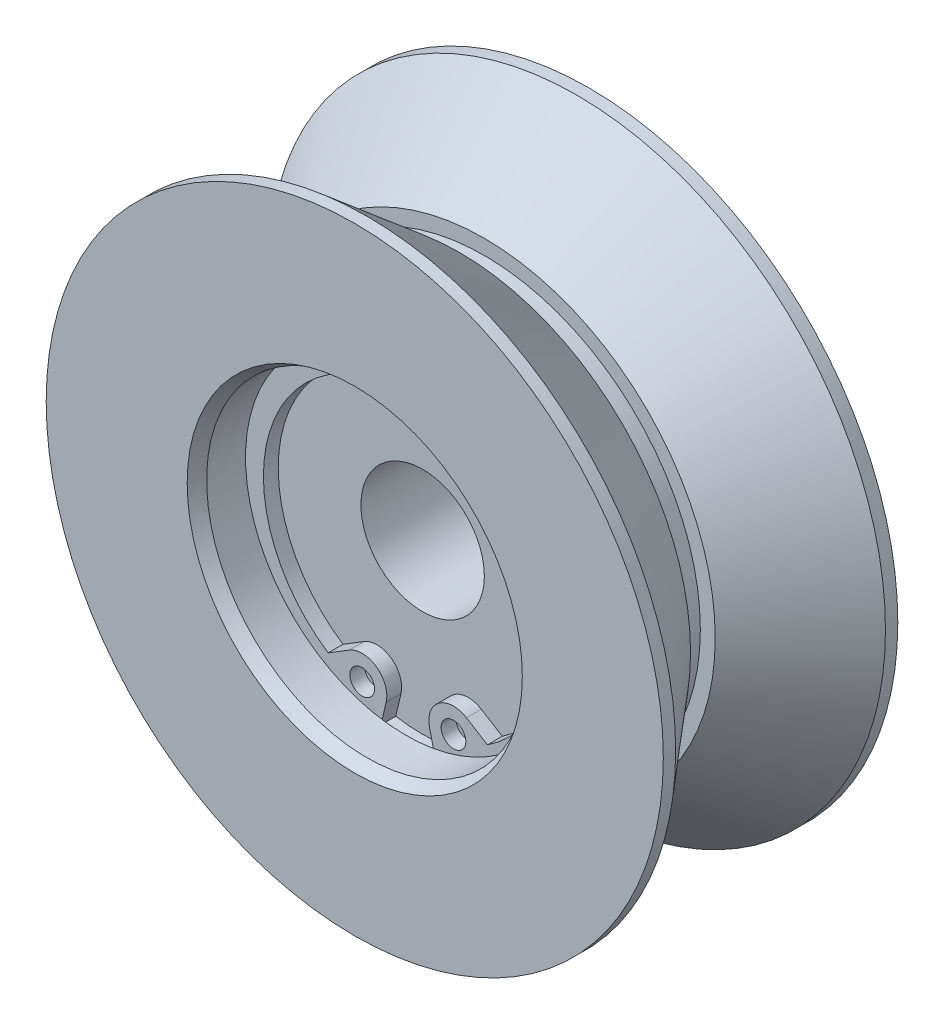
ISO-10303-21;
HEADER;
FILE_DESCRIPTION(('STEP AP214'),'2;1');
FILE_NAME('part.step','',(''),(''),'','','');
FILE_SCHEMA(('AUTOMOTIVE_DESIGN { 1 0 10303 214 1 1 1 1 }'));
ENDSEC;
DATA;
#1=APPLICATION_CONTEXT('core data for automotive mechanical design processes');
#2=APPLICATION_PROTOCOL_DEFINITION('international standard','automotive_design',2000,#1);
#3=PRODUCT_CONTEXT('',#1,'mechanical');
#4=PRODUCT('Part','Part','',(#3));
#5=PRODUCT_RELATED_PRODUCT_CATEGORY('part','',(#4));
#6=PRODUCT_DEFINITION_FORMATION('','',#4);
#7=PRODUCT_DEFINITION_CONTEXT('part definition',#1,'design');
#8=PRODUCT_DEFINITION('design','',#6,#7);
#9=PRODUCT_DEFINITION_SHAPE('','',#8);
#10=(LENGTH_UNIT() NAMED_UNIT(*) SI_UNIT(.MILLI.,.METRE.));
#11=(NAMED_UNIT(*) PLANE_ANGLE_UNIT() SI_UNIT($,.RADIAN.));
#12=(NAMED_UNIT(*) SI_UNIT($,.STERADIAN.) SOLID_ANGLE_UNIT());
#13=UNCERTAINTY_MEASURE_WITH_UNIT(LENGTH_MEASURE(1.E-05),#10,'distance_accuracy_value','');
#14=(GEOMETRIC_REPRESENTATION_CONTEXT(3) GLOBAL_UNCERTAINTY_ASSIGNED_CONTEXT((#13)) GLOBAL_UNIT_ASSIGNED_CONTEXT((#10,
#11,#12)) REPRESENTATION_CONTEXT('',''));
#15=CARTESIAN_POINT('',(0.,0.,0.));
#16=DIRECTION('',(0.,0.,1.));
#17=DIRECTION('',(1.,0.,0.));
#18=AXIS2_PLACEMENT_3D('',#15,#16,#17);
#19=CARTESIAN_POINT('',(0.,5.,4.));
#20=DIRECTION('',(0.,0.,-1.));
#21=DIRECTION('',(-1.,0.,0.));
#22=AXIS2_PLACEMENT_3D('',#19,#20,#21);
#23=PLANE('',#22);
#24=CARTESIAN_POINT('',(3.7,-11.165302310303,4.));
#25=DIRECTION('',(0.,0.,-1.));
#26=DIRECTION('',(-1.,0.,0.));
#27=AXIS2_PLACEMENT_3D('',#24,#25,#26);
#28=CIRCLE('',#27,1.);
#29=CARTESIAN_POINT('',(2.7,-11.165302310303,4.));
#30=VERTEX_POINT('',#29);
#31=EDGE_CURVE('E562',#30,#30,#28,.T.);
#32=ORIENTED_EDGE('',*,*,#31,.F.);
#33=EDGE_LOOP('',(#32));
#34=FACE_BOUND('',#33,.T.);
#35=ADVANCED_FACE('F14',(#34),#23,.F.);
#36=CARTESIAN_POINT('',(-3.7,-11.165302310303,4.));
#37=DIRECTION('',(0.,0.,-1.));
#38=DIRECTION('',(-1.,0.,0.));
#39=AXIS2_PLACEMENT_3D('',#36,#37,#38);
#40=CIRCLE('',#39,1.);
#41=CARTESIAN_POINT('',(-4.7,-11.165302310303,4.));
#42=VERTEX_POINT('',#41);
#43=EDGE_CURVE('E565',#42,#42,#40,.T.);
#44=ORIENTED_EDGE('',*,*,#43,.F.);
#45=EDGE_LOOP('',(#44));
#46=FACE_BOUND('',#45,.T.);
#47=ADVANCED_FACE('F298',(#46),#23,.F.);
#48=CARTESIAN_POINT('',(0.,0.,22.1183293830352));
#49=DIRECTION('',(0.,0.,1.));
#50=DIRECTION('',(1.,0.,0.));
#51=AXIS2_PLACEMENT_3D('',#48,#49,#50);
#52=CYLINDRICAL_SURFACE('',#51,17.5);
#53=CARTESIAN_POINT('',(0.,0.,1.));
#54=DIRECTION('',(0.,0.,1.));
#55=DIRECTION('',(1.,0.,0.));
#56=AXIS2_PLACEMENT_3D('',#53,#54,#55);
#57=CIRCLE('',#56,17.5);
#58=CARTESIAN_POINT('',(17.5,0.,1.));
#59=VERTEX_POINT('',#58);
#60=EDGE_CURVE('E550',#59,#59,#57,.T.);
#61=ORIENTED_EDGE('',*,*,#60,.F.);
#62=EDGE_LOOP('',(#61));
#63=FACE_BOUND('',#62,.T.);
#64=CARTESIAN_POINT('',(0.,0.,-1.));
#65=DIRECTION('',(0.,0.,1.));
#66=DIRECTION('',(1.,0.,0.));
#67=AXIS2_PLACEMENT_3D('',#64,#65,#66);
#68=CIRCLE('',#67,17.5);
#69=CARTESIAN_POINT('',(17.5,0.,-1.));
#70=VERTEX_POINT('',#69);
#71=EDGE_CURVE('E553',#70,#70,#68,.T.);
#72=ORIENTED_EDGE('',*,*,#71,.T.);
#73=EDGE_LOOP('',(#72));
#74=FACE_BOUND('',#73,.T.);
#75=ADVANCED_FACE('F317',(#63,#74),#52,.T.);
#76=CARTESIAN_POINT('',(0.,17.5,1.));
#77=DIRECTION('',(0.,0.,1.));
#78=DIRECTION('',(1.,0.,0.));
#79=AXIS2_PLACEMENT_3D('',#76,#77,#78);
#80=PLANE('',#79);
#81=CARTESIAN_POINT('',(0.,0.,1.));
#82=DIRECTION('',(0.,0.,1.));
#83=DIRECTION('',(1.,0.,0.));
#84=AXIS2_PLACEMENT_3D('',#81,#82,#83);
#85=CIRCLE('',#84,18.7067527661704);
#86=CARTESIAN_POINT('',(18.7067527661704,0.,1.));
#87=VERTEX_POINT('',#86);
#88=EDGE_CURVE('E547',#87,#87,#85,.T.);
#89=ORIENTED_EDGE('',*,*,#88,.F.);
#90=EDGE_LOOP('',(#89));
#91=FACE_BOUND('',#90,.T.);
#92=ORIENTED_EDGE('',*,*,#60,.T.);
#93=EDGE_LOOP('',(#92));
#94=FACE_BOUND('',#93,.T.);
#95=ADVANCED_FACE('F358',(#91,#94),#80,.F.);
#96=CARTESIAN_POINT('',(0.,17.5,-1.));
#97=DIRECTION('',(0.,0.,-1.));
#98=DIRECTION('',(-1.,0.,0.));
#99=AXIS2_PLACEMENT_3D('',#96,#97,#98);
#100=PLANE('',#99);
#101=ORIENTED_EDGE('',*,*,#71,.F.);
#102=EDGE_LOOP('',(#101));
#103=FACE_BOUND('',#102,.T.);
#104=CARTESIAN_POINT('',(0.,0.,-1.));
#105=DIRECTION('',(0.,0.,1.));
#106=DIRECTION('',(1.,0.,0.));
#107=AXIS2_PLACEMENT_3D('',#104,#105,#106);
#108=CIRCLE('',#107,18.7067527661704);
#109=CARTESIAN_POINT('',(18.7067527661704,0.,-1.));
#110=VERTEX_POINT('',#109);
#111=EDGE_CURVE('E556',#110,#110,#108,.T.);
#112=ORIENTED_EDGE('',*,*,#111,.T.);
#113=EDGE_LOOP('',(#112));
#114=FACE_BOUND('',#113,.T.);
#115=ADVANCED_FACE('F353',(#103,#114),#100,.F.);
#116=CARTESIAN_POINT('',(0.,0.,1.));
#117=DIRECTION('',(0.,0.,1.));
#118=DIRECTION('',(1.,0.,0.));
#119=AXIS2_PLACEMENT_3D('',#116,#117,#118);
#120=CONICAL_SURFACE('',#119,18.7067527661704,0.69813170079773);
#121=CARTESIAN_POINT('',(0.,0.,8.5));
#122=DIRECTION('',(0.,0.,1.));
#123=DIRECTION('',(1.,0.,0.));
#124=AXIS2_PLACEMENT_3D('',#121,#122,#123);
#125=CIRCLE('',#124,25.);
#126=CARTESIAN_POINT('',(25.,0.,8.5));
#127=VERTEX_POINT('',#126);
#128=EDGE_CURVE('E544',#127,#127,#125,.T.);
#129=ORIENTED_EDGE('',*,*,#128,.F.);
#130=EDGE_LOOP('',(#129));
#131=FACE_BOUND('',#130,.T.);
#132=ORIENTED_EDGE('',*,*,#88,.T.);
#133=EDGE_LOOP('',(#132));
#134=FACE_BOUND('',#133,.T.);
#135=ADVANCED_FACE('F347',(#131,#134),#120,.T.);
#136=CARTESIAN_POINT('',(0.,0.,-8.5));
#137=DIRECTION('',(0.,0.,-1.));
#138=DIRECTION('',(-1.,0.,0.));
#139=AXIS2_PLACEMENT_3D('',#136,#137,#138);
#140=CONICAL_SURFACE('',#139,25.,0.69813170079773);
#141=ORIENTED_EDGE('',*,*,#111,.F.);
#142=EDGE_LOOP('',(#141));
#143=FACE_BOUND('',#142,.T.);
#144=CARTESIAN_POINT('',(0.,0.,-8.5));
#145=DIRECTION('',(0.,0.,1.));
#146=DIRECTION('',(1.,0.,0.));
#147=AXIS2_PLACEMENT_3D('',#144,#145,#146);
#148=CIRCLE('',#147,25.);
#149=CARTESIAN_POINT('',(25.,0.,-8.5));
#150=VERTEX_POINT('',#149);
#151=EDGE_CURVE('E559',#150,#150,#148,.T.);
#152=ORIENTED_EDGE('',*,*,#151,.T.);
#153=EDGE_LOOP('',(#152));
#154=FACE_BOUND('',#153,.T.);
#155=ADVANCED_FACE('F342',(#143,#154),#140,.T.);
#156=CARTESIAN_POINT('',(0.,0.,22.1183293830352));
#157=DIRECTION('',(0.,0.,1.));
#158=DIRECTION('',(1.,0.,0.));
#159=AXIS2_PLACEMENT_3D('',#156,#157,#158);
#160=CYLINDRICAL_SURFACE('',#159,25.);
#161=CARTESIAN_POINT('',(0.,0.,9.5));
#162=DIRECTION('',(0.,0.,1.));
#163=DIRECTION('',(1.,0.,0.));
#164=AXIS2_PLACEMENT_3D('',#161,#162,#163);
#165=CIRCLE('',#164,25.);
#166=CARTESIAN_POINT('',(25.,0.,9.5));
#167=VERTEX_POINT('',#166);
#168=EDGE_CURVE('E541',#167,#167,#165,.T.);
#169=ORIENTED_EDGE('',*,*,#168,.F.);
#170=EDGE_LOOP('',(#169));
#171=FACE_BOUND('',#170,.T.);
#172=ORIENTED_EDGE('',*,*,#128,.T.);
#173=EDGE_LOOP('',(#172));
#174=FACE_BOUND('',#173,.T.);
#175=ADVANCED_FACE('F335',(#171,#174),#160,.T.);
#176=CARTESIAN_POINT('',(0.,0.,22.1183293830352));
#177=DIRECTION('',(0.,0.,1.));
#178=DIRECTION('',(1.,0.,0.));
#179=AXIS2_PLACEMENT_3D('',#176,#177,#178);
#180=CYLINDRICAL_SURFACE('',#179,25.);
#181=ORIENTED_EDGE('',*,*,#151,.F.);
#182=EDGE_LOOP('',(#181));
#183=FACE_BOUND('',#182,.T.);
#184=CARTESIAN_POINT('',(0.,0.,-9.5));
#185=DIRECTION('',(0.,0.,1.));
#186=DIRECTION('',(1.,0.,0.));
#187=AXIS2_PLACEMENT_3D('',#184,#185,#186);
#188=CIRCLE('',#187,25.);
#189=CARTESIAN_POINT('',(25.,0.,-9.5));
#190=VERTEX_POINT('',#189);
#191=EDGE_CURVE('E107',#190,#190,#188,.T.);
#192=ORIENTED_EDGE('',*,*,#191,.T.);
#193=EDGE_LOOP('',(#192));
#194=FACE_BOUND('',#193,.T.);
#195=ADVANCED_FACE('F329',(#183,#194),#180,.T.);
#196=CARTESIAN_POINT('',(0.,25.,9.5));
#197=DIRECTION('',(0.,0.,-1.));
#198=DIRECTION('',(-1.,0.,0.));
#199=AXIS2_PLACEMENT_3D('',#196,#197,#198);
#200=PLANE('',#199);
#201=CARTESIAN_POINT('',(0.,0.,9.5));
#202=DIRECTION('',(0.,0.,1.));
#203=DIRECTION('',(1.,0.,0.));
#204=AXIS2_PLACEMENT_3D('',#201,#202,#203);
#205=CIRCLE('',#204,13.5773502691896);
#206=CARTESIAN_POINT('',(13.5773502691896,0.,9.5));
#207=VERTEX_POINT('',#206);
#208=EDGE_CURVE('E538',#207,#207,#205,.T.);
#209=ORIENTED_EDGE('',*,*,#208,.F.);
#210=EDGE_LOOP('',(#209));
#211=FACE_BOUND('',#210,.T.);
#212=ORIENTED_EDGE('',*,*,#168,.T.);
#213=EDGE_LOOP('',(#212));
#214=FACE_BOUND('',#213,.T.);
#215=ADVANCED_FACE('F334',(#211,#214),#200,.F.);
#216=CARTESIAN_POINT('',(0.,11.,-9.5));
#217=DIRECTION('',(0.,0.,1.));
#218=DIRECTION('',(1.,0.,0.));
#219=AXIS2_PLACEMENT_3D('',#216,#217,#218);
#220=PLANE('',#219);
#221=ORIENTED_EDGE('',*,*,#191,.F.);
#222=EDGE_LOOP('',(#221));
#223=FACE_BOUND('',#222,.T.);
#224=CARTESIAN_POINT('',(0.,0.,-9.5));
#225=DIRECTION('',(0.,0.,1.));
#226=DIRECTION('',(1.,0.,0.));
#227=AXIS2_PLACEMENT_3D('',#224,#225,#226);
#228=CIRCLE('',#227,11.);
#229=CARTESIAN_POINT('',(11.,0.,-9.5));
#230=VERTEX_POINT('',#229);
#231=EDGE_CURVE('E513',#230,#230,#228,.T.);
#232=ORIENTED_EDGE('',*,*,#231,.T.);
#233=EDGE_LOOP('',(#232));
#234=FACE_BOUND('',#233,.T.);
#235=ADVANCED_FACE('F395',(#223,#234),#220,.F.);
#236=CARTESIAN_POINT('',(0.,0.,9.5));
#237=DIRECTION('',(0.,0.,1.));
#238=DIRECTION('',(1.,0.,0.));
#239=AXIS2_PLACEMENT_3D('',#236,#237,#238);
#240=CONICAL_SURFACE('',#239,13.5773502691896,0.5235987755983);
#241=CARTESIAN_POINT('',(0.,0.,8.5));
#242=DIRECTION('',(0.,0.,1.));
#243=DIRECTION('',(1.,0.,0.));
#244=AXIS2_PLACEMENT_3D('',#241,#242,#243);
#245=CIRCLE('',#244,13.);
#246=CARTESIAN_POINT('',(13.,0.,8.5));
#247=VERTEX_POINT('',#246);
#248=EDGE_CURVE('E535',#247,#247,#245,.T.);
#249=ORIENTED_EDGE('',*,*,#248,.F.);
#250=EDGE_LOOP('',(#249));
#251=FACE_BOUND('',#250,.T.);
#252=ORIENTED_EDGE('',*,*,#208,.T.);
#253=EDGE_LOOP('',(#252));
#254=FACE_BOUND('',#253,.T.);
#255=ADVANCED_FACE('F401',(#251,#254),#240,.F.);
#256=CARTESIAN_POINT('',(0.,0.,22.1183293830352));
#257=DIRECTION('',(0.,0.,1.));
#258=DIRECTION('',(1.,0.,0.));
#259=AXIS2_PLACEMENT_3D('',#256,#257,#258);
#260=CYLINDRICAL_SURFACE('',#259,11.);
#261=ORIENTED_EDGE('',*,*,#231,.F.);
#262=EDGE_LOOP('',(#261));
#263=FACE_BOUND('',#262,.T.);
#264=CARTESIAN_POINT('',(0.,0.,-4.));
#265=DIRECTION('',(0.,0.,1.));
#266=DIRECTION('',(1.,0.,0.));
#267=AXIS2_PLACEMENT_3D('',#264,#265,#266);
#268=CIRCLE('',#267,11.);
#269=CARTESIAN_POINT('',(11.,0.,-4.));
#270=VERTEX_POINT('',#269);
#271=EDGE_CURVE('E514',#270,#270,#268,.T.);
#272=ORIENTED_EDGE('',*,*,#271,.T.);
#273=EDGE_LOOP('',(#272));
#274=FACE_BOUND('',#273,.T.);
#275=ADVANCED_FACE('F406',(#263,#274),#260,.F.);
#276=CARTESIAN_POINT('',(0.,0.,22.1183293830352));
#277=DIRECTION('',(0.,0.,1.));
#278=DIRECTION('',(1.,0.,0.));
#279=AXIS2_PLACEMENT_3D('',#276,#277,#278);
#280=CYLINDRICAL_SURFACE('',#279,13.);
#281=CARTESIAN_POINT('',(0.,0.,5.35));
#282=DIRECTION('',(0.,0.,1.));
#283=DIRECTION('',(1.,0.,0.));
#284=AXIS2_PLACEMENT_3D('',#281,#282,#283);
#285=CIRCLE('',#284,13.);
#286=CARTESIAN_POINT('',(13.,0.,5.35));
#287=VERTEX_POINT('',#286);
#288=EDGE_CURVE('E532',#287,#287,#285,.T.);
#289=ORIENTED_EDGE('',*,*,#288,.F.);
#290=EDGE_LOOP('',(#289));
#291=FACE_BOUND('',#290,.T.);
#292=ORIENTED_EDGE('',*,*,#248,.T.);
#293=EDGE_LOOP('',(#292));
#294=FACE_BOUND('',#293,.T.);
#295=ADVANCED_FACE('F412',(#291,#294),#280,.F.);
#296=CARTESIAN_POINT('',(0.,11.,-4.));
#297=DIRECTION('',(0.,0.,1.));
#298=DIRECTION('',(1.,0.,0.));
#299=AXIS2_PLACEMENT_3D('',#296,#297,#298);
#300=PLANE('',#299);
#301=ORIENTED_EDGE('',*,*,#271,.F.);
#302=EDGE_LOOP('',(#301));
#303=FACE_BOUND('',#302,.T.);
#304=CARTESIAN_POINT('',(0.,0.,-4.));
#305=DIRECTION('',(0.,0.,1.));
#306=DIRECTION('',(1.,0.,0.));
#307=AXIS2_PLACEMENT_3D('',#304,#305,#306);
#308=CIRCLE('',#307,5.);
#309=CARTESIAN_POINT('',(5.,0.,-4.));
#310=VERTEX_POINT('',#309);
#311=EDGE_CURVE('E517',#310,#310,#308,.T.);
#312=ORIENTED_EDGE('',*,*,#311,.T.);
#313=EDGE_LOOP('',(#312));
#314=FACE_BOUND('',#313,.T.);
#315=ADVANCED_FACE('F417',(#303,#314),#300,.F.);
#316=CARTESIAN_POINT('',(0.,13.6,5.35));
#317=DIRECTION('',(0.,0.,1.));
#318=DIRECTION('',(1.,0.,0.));
#319=AXIS2_PLACEMENT_3D('',#316,#317,#318);
#320=PLANE('',#319);
#321=CARTESIAN_POINT('',(0.,0.,5.35));
#322=DIRECTION('',(0.,0.,1.));
#323=DIRECTION('',(1.,0.,0.));
#324=AXIS2_PLACEMENT_3D('',#321,#322,#323);
#325=CIRCLE('',#324,13.6);
#326=CARTESIAN_POINT('',(13.6,0.,5.35));
#327=VERTEX_POINT('',#326);
#328=EDGE_CURVE('E529',#327,#327,#325,.T.);
#329=ORIENTED_EDGE('',*,*,#328,.F.);
#330=EDGE_LOOP('',(#329));
#331=FACE_BOUND('',#330,.T.);
#332=ORIENTED_EDGE('',*,*,#288,.T.);
#333=EDGE_LOOP('',(#332));
#334=FACE_BOUND('',#333,.T.);
#335=ADVANCED_FACE('F307',(#331,#334),#320,.F.);
#336=CARTESIAN_POINT('',(0.,0.,22.1183293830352));
#337=DIRECTION('',(0.,0.,1.));
#338=DIRECTION('',(1.,0.,0.));
#339=AXIS2_PLACEMENT_3D('',#336,#337,#338);
#340=CYLINDRICAL_SURFACE('',#339,13.6);
#341=ORIENTED_EDGE('',*,*,#328,.T.);
#342=EDGE_LOOP('',(#341));
#343=FACE_BOUND('',#342,.T.);
#344=DIRECTION('',(0.,0.,1.));
#345=VECTOR('',#344,1.);
#346=CARTESIAN_POINT('',(2.1813307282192,-13.4239262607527,22.1183293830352));
#347=LINE('',#346,#345);
#348=CARTESIAN_POINT('',(2.1813307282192,-13.4239262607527,4.));
#349=VERTEX_POINT('',#348);
#350=CARTESIAN_POINT('',(2.1813307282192,-13.4239262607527,5.2));
#351=VERTEX_POINT('',#350);
#352=EDGE_CURVE('E9',#349,#351,#347,.T.);
#353=ORIENTED_EDGE('',*,*,#352,.F.);
#354=CARTESIAN_POINT('',(0.,0.,4.));
#355=DIRECTION('',(0.,0.,1.));
#356=DIRECTION('',(1.,0.,0.));
#357=AXIS2_PLACEMENT_3D('',#354,#355,#356);
#358=CIRCLE('',#357,13.6);
#359=CARTESIAN_POINT('',(-2.18133072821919,-13.4239262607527,4.));
#360=VERTEX_POINT('',#359);
#361=EDGE_CURVE('E526',#360,#349,#358,.T.);
#362=ORIENTED_EDGE('',*,*,#361,.F.);
#363=DIRECTION('',(0.,0.,1.));
#364=VECTOR('',#363,1.);
#365=CARTESIAN_POINT('',(-2.18133072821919,-13.4239262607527,22.1183293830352));
#366=LINE('',#365,#364);
#367=CARTESIAN_POINT('',(-2.18133072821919,-13.4239262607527,5.2));
#368=VERTEX_POINT('',#367);
#369=EDGE_CURVE('E109',#368,#360,#366,.F.);
#370=ORIENTED_EDGE('',*,*,#369,.F.);
#371=CARTESIAN_POINT('',(0.,0.,5.2));
#372=DIRECTION('',(0.,0.,-1.));
#373=DIRECTION('',(-1.,0.,0.));
#374=AXIS2_PLACEMENT_3D('',#371,#372,#373);
#375=CIRCLE('',#374,13.6);
#376=EDGE_CURVE('E23',#351,#368,#375,.F.);
#377=ORIENTED_EDGE('',*,*,#376,.F.);
#378=EDGE_LOOP('',(#353,#362,#370,#377));
#379=FACE_BOUND('',#378,.T.);
#380=ADVANCED_FACE('F302',(#343,#379),#340,.F.);
#381=CARTESIAN_POINT('',(0.,0.,22.1183293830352));
#382=DIRECTION('',(0.,0.,1.));
#383=DIRECTION('',(1.,0.,0.));
#384=AXIS2_PLACEMENT_3D('',#381,#382,#383);
#385=CYLINDRICAL_SURFACE('',#384,5.);
#386=ORIENTED_EDGE('',*,*,#311,.F.);
#387=EDGE_LOOP('',(#386));
#388=FACE_BOUND('',#387,.T.);
#389=CARTESIAN_POINT('',(0.,0.,4.));
#390=DIRECTION('',(0.,0.,1.));
#391=DIRECTION('',(1.,0.,0.));
#392=AXIS2_PLACEMENT_3D('',#389,#390,#391);
#393=CIRCLE('',#392,5.);
#394=CARTESIAN_POINT('',(5.,0.,4.));
#395=VERTEX_POINT('',#394);
#396=EDGE_CURVE('E523',#395,#395,#393,.T.);
#397=ORIENTED_EDGE('',*,*,#396,.T.);
#398=EDGE_LOOP('',(#397));
#399=FACE_BOUND('',#398,.T.);
#400=ADVANCED_FACE('F295',(#388,#399),#385,.F.);
#401=ORIENTED_EDGE('',*,*,#396,.F.);
#402=EDGE_LOOP('',(#401));
#403=FACE_BOUND('',#402,.T.);
#404=DIRECTION('',(0.231349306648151,-0.972870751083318,0.));
#405=VECTOR('',#404,1.);
#406=CARTESIAN_POINT('',(-2.08214742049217,4.50486396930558,4.));
#407=LINE('',#406,#405);
#408=CARTESIAN_POINT('',(1.75425849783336,-11.6280009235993,4.));
#409=VERTEX_POINT('',#408);
#410=EDGE_CURVE('E111',#409,#349,#407,.T.);
#411=ORIENTED_EDGE('',*,*,#410,.F.);
#412=CARTESIAN_POINT('',(3.7,-11.165302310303,4.));
#413=DIRECTION('',(0.,0.,-1.));
#414=DIRECTION('',(-1.,0.,0.));
#415=AXIS2_PLACEMENT_3D('',#412,#413,#414);
#416=CIRCLE('',#415,2.);
#417=CARTESIAN_POINT('',(4.74866968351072,-9.46227797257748,4.));
#418=VERTEX_POINT('',#417);
#419=EDGE_CURVE('E89',#409,#418,#416,.T.);
#420=ORIENTED_EDGE('',*,*,#419,.T.);
#421=DIRECTION('',(-0.851512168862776,0.524334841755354,0.));
#422=VECTOR('',#421,1.);
#423=CARTESIAN_POINT('',(-5.1515440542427,-3.36603273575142,4.));
#424=LINE('',#423,#422);
#425=CARTESIAN_POINT('',(6.45127454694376,-10.5106893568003,4.));
#426=VERTEX_POINT('',#425);
#427=EDGE_CURVE('E124',#426,#418,#424,.T.);
#428=ORIENTED_EDGE('',*,*,#427,.F.);
#429=CARTESIAN_POINT('',(0.,-0.75,4.));
#430=DIRECTION('',(0.,0.,-1.));
#431=DIRECTION('',(-1.,0.,0.));
#432=AXIS2_PLACEMENT_3D('',#429,#430,#431);
#433=CIRCLE('',#432,11.7);
#434=CARTESIAN_POINT('',(-6.45127454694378,-10.5106893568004,4.));
#435=VERTEX_POINT('',#434);
#436=EDGE_CURVE('E580',#435,#426,#433,.T.);
#437=ORIENTED_EDGE('',*,*,#436,.F.);
#438=DIRECTION('',(-0.851512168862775,-0.524334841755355,0.));
#439=VECTOR('',#438,1.);
#440=CARTESIAN_POINT('',(5.1515440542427,-3.3660327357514,4.));
#441=LINE('',#440,#439);
#442=CARTESIAN_POINT('',(-4.74866968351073,-9.46227797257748,4.));
#443=VERTEX_POINT('',#442);
#444=EDGE_CURVE('E576',#443,#435,#441,.T.);
#445=ORIENTED_EDGE('',*,*,#444,.F.);
#446=CARTESIAN_POINT('',(-3.7,-11.165302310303,4.));
#447=DIRECTION('',(0.,0.,-1.));
#448=DIRECTION('',(-1.,0.,0.));
#449=AXIS2_PLACEMENT_3D('',#446,#447,#448);
#450=CIRCLE('',#449,2.);
#451=CARTESIAN_POINT('',(-1.75425849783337,-11.6280009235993,4.));
#452=VERTEX_POINT('',#451);
#453=EDGE_CURVE('E569',#443,#452,#450,.T.);
#454=ORIENTED_EDGE('',*,*,#453,.T.);
#455=DIRECTION('',(0.231349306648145,0.97287075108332,0.));
#456=VECTOR('',#455,1.);
#457=CARTESIAN_POINT('',(2.08214742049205,4.50486396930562,4.));
#458=LINE('',#457,#456);
#459=EDGE_CURVE('E573',#360,#452,#458,.T.);
#460=ORIENTED_EDGE('',*,*,#459,.F.);
#461=ORIENTED_EDGE('',*,*,#361,.T.);
#462=EDGE_LOOP('',(#411,#420,#428,#437,#445,#454,#460,#461));
#463=FACE_BOUND('',#462,.T.);
#464=ADVANCED_FACE('F217',(#403,#463),#23,.F.);
#465=CARTESIAN_POINT('',(0.,-0.75,5.2));
#466=DIRECTION('',(0.,0.,1.));
#467=DIRECTION('',(-1.,0.,0.));
#468=AXIS2_PLACEMENT_3D('',#465,#466,#467);
#469=CYLINDRICAL_SURFACE('',#468,11.7);
#470=ORIENTED_EDGE('',*,*,#436,.T.);
#471=DIRECTION('',(0.,0.,-1.));
#472=VECTOR('',#471,1.);
#473=CARTESIAN_POINT('',(6.45127454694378,-10.5106893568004,5.2));
#474=LINE('',#473,#472);
#475=CARTESIAN_POINT('',(6.45127454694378,-10.5106893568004,5.2));
#476=VERTEX_POINT('',#475);
#477=EDGE_CURVE('E128',#476,#426,#474,.T.);
#478=ORIENTED_EDGE('',*,*,#477,.F.);
#479=CARTESIAN_POINT('',(0.,-0.75,5.2));
#480=DIRECTION('',(0.,0.,-1.));
#481=DIRECTION('',(0.,-1.,0.));
#482=AXIS2_PLACEMENT_3D('',#479,#480,#481);
#483=CIRCLE('',#482,11.7);
#484=CARTESIAN_POINT('',(-6.45127454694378,-10.5106893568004,5.2));
#485=VERTEX_POINT('',#484);
#486=EDGE_CURVE('E136',#485,#476,#483,.T.);
#487=ORIENTED_EDGE('',*,*,#486,.F.);
#488=DIRECTION('',(0.,0.,-1.));
#489=VECTOR('',#488,1.);
#490=CARTESIAN_POINT('',(-6.45127454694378,-10.5106893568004,5.2));
#491=LINE('',#490,#489);
#492=EDGE_CURVE('E108',#485,#435,#491,.T.);
#493=ORIENTED_EDGE('',*,*,#492,.T.);
#494=EDGE_LOOP('',(#470,#478,#487,#493));
#495=FACE_BOUND('',#494,.T.);
#496=ADVANCED_FACE('F16',(#495),#469,.F.);
#497=CARTESIAN_POINT('',(4.74866968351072,-9.46227797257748,5.2));
#498=DIRECTION('',(-0.524334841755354,-0.851512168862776,0.));
#499=DIRECTION('',(-0.851512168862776,0.524334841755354,0.));
#500=AXIS2_PLACEMENT_3D('',#497,#498,#499);
#501=PLANE('',#500);
#502=ORIENTED_EDGE('',*,*,#427,.T.);
#503=DIRECTION('',(0.,0.,-1.));
#504=VECTOR('',#503,1.);
#505=CARTESIAN_POINT('',(4.74866968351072,-9.46227797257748,5.2));
#506=LINE('',#505,#504);
#507=CARTESIAN_POINT('',(4.74866968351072,-9.46227797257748,5.2));
#508=VERTEX_POINT('',#507);
#509=EDGE_CURVE('E91',#508,#418,#506,.T.);
#510=ORIENTED_EDGE('',*,*,#509,.F.);
#511=DIRECTION('',(-0.851512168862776,0.524334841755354,0.));
#512=VECTOR('',#511,1.);
#513=CARTESIAN_POINT('',(4.74866968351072,-9.46227797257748,5.2));
#514=LINE('',#513,#512);
#515=EDGE_CURVE('E81',#476,#508,#514,.T.);
#516=ORIENTED_EDGE('',*,*,#515,.F.);
#517=ORIENTED_EDGE('',*,*,#477,.T.);
#518=EDGE_LOOP('',(#502,#510,#516,#517));
#519=FACE_BOUND('',#518,.T.);
#520=ADVANCED_FACE('F201',(#519),#501,.F.);
#521=CARTESIAN_POINT('',(3.7,-11.165302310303,5.2));
#522=DIRECTION('',(0.,0.,1.));
#523=DIRECTION('',(-1.,0.,0.));
#524=AXIS2_PLACEMENT_3D('',#521,#522,#523);
#525=CYLINDRICAL_SURFACE('',#524,2.);
#526=ORIENTED_EDGE('',*,*,#419,.F.);
#527=DIRECTION('',(0.,0.,-1.));
#528=VECTOR('',#527,1.);
#529=CARTESIAN_POINT('',(1.75425849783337,-11.6280009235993,5.2));
#530=LINE('',#529,#528);
#531=CARTESIAN_POINT('',(1.75425849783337,-11.6280009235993,5.2));
#532=VERTEX_POINT('',#531);
#533=EDGE_CURVE('E73',#532,#409,#530,.T.);
#534=ORIENTED_EDGE('',*,*,#533,.F.);
#535=CARTESIAN_POINT('',(3.7,-11.165302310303,5.2));
#536=DIRECTION('',(0.,0.,1.));
#537=DIRECTION('',(1.,0.,0.));
#538=AXIS2_PLACEMENT_3D('',#535,#536,#537);
#539=CIRCLE('',#538,2.);
#540=EDGE_CURVE('E75',#508,#532,#539,.T.);
#541=ORIENTED_EDGE('',*,*,#540,.F.);
#542=ORIENTED_EDGE('',*,*,#509,.T.);
#543=EDGE_LOOP('',(#526,#534,#541,#542));
#544=FACE_BOUND('',#543,.T.);
#545=ADVANCED_FACE('F87',(#544),#525,.T.);
#546=CARTESIAN_POINT('',(-1.75425849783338,-11.6280009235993,5.2));
#547=DIRECTION('',(-0.97287075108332,0.231349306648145,0.));
#548=DIRECTION('',(0.,0.,1.));
#549=AXIS2_PLACEMENT_3D('',#546,#547,#548);
#550=PLANE('',#549);
#551=DIRECTION('',(0.231349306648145,0.97287075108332,0.));
#552=VECTOR('',#551,1.);
#553=CARTESIAN_POINT('',(-1.75425849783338,-11.6280009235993,5.2));
#554=LINE('',#553,#552);
#555=CARTESIAN_POINT('',(-1.75425849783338,-11.6280009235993,5.2));
#556=VERTEX_POINT('',#555);
#557=EDGE_CURVE('E61',#368,#556,#554,.T.);
#558=ORIENTED_EDGE('',*,*,#557,.F.);
#559=ORIENTED_EDGE('',*,*,#369,.T.);
#560=ORIENTED_EDGE('',*,*,#459,.T.);
#561=DIRECTION('',(0.,0.,-1.));
#562=VECTOR('',#561,1.);
#563=CARTESIAN_POINT('',(-1.75425849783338,-11.6280009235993,5.2));
#564=LINE('',#563,#562);
#565=EDGE_CURVE('E92',#556,#452,#564,.T.);
#566=ORIENTED_EDGE('',*,*,#565,.F.);
#567=EDGE_LOOP('',(#558,#559,#560,#566));
#568=FACE_BOUND('',#567,.T.);
#569=ADVANCED_FACE('F200',(#568),#550,.F.);
#570=CARTESIAN_POINT('',(0.,-0.75,5.2));
#571=DIRECTION('',(0.,0.,-1.));
#572=DIRECTION('',(0.,-1.,0.));
#573=AXIS2_PLACEMENT_3D('',#570,#571,#572);
#574=PLANE('',#573);
#575=CARTESIAN_POINT('',(-3.7,-11.165302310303,5.2));
#576=DIRECTION('',(0.,0.,-1.));
#577=DIRECTION('',(1.,0.,0.));
#578=AXIS2_PLACEMENT_3D('',#575,#576,#577);
#579=CIRCLE('',#578,1.);
#580=CARTESIAN_POINT('',(-2.7,-11.165302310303,5.2));
#581=VERTEX_POINT('',#580);
#582=EDGE_CURVE('E97',#581,#581,#579,.T.);
#583=ORIENTED_EDGE('',*,*,#582,.T.);
#584=EDGE_LOOP('',(#583));
#585=FACE_BOUND('',#584,.T.);
#586=CARTESIAN_POINT('',(3.7,-11.165302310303,5.2));
#587=DIRECTION('',(0.,0.,1.));
#588=DIRECTION('',(1.,0.,0.));
#589=AXIS2_PLACEMENT_3D('',#586,#587,#588);
#590=CIRCLE('',#589,1.);
#591=CARTESIAN_POINT('',(4.7,-11.165302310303,5.2));
#592=VERTEX_POINT('',#591);
#593=EDGE_CURVE('E100',#592,#592,#590,.T.);
#594=ORIENTED_EDGE('',*,*,#593,.F.);
#595=EDGE_LOOP('',(#594));
#596=FACE_BOUND('',#595,.T.);
#597=DIRECTION('',(0.231349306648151,-0.972870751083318,0.));
#598=VECTOR('',#597,1.);
#599=CARTESIAN_POINT('',(1.75425849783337,-11.6280009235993,5.2));
#600=LINE('',#599,#598);
#601=EDGE_CURVE('E68',#532,#351,#600,.T.);
#602=ORIENTED_EDGE('',*,*,#601,.T.);
#603=ORIENTED_EDGE('',*,*,#376,.T.);
#604=ORIENTED_EDGE('',*,*,#557,.T.);
#605=CARTESIAN_POINT('',(-3.7,-11.165302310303,5.2));
#606=DIRECTION('',(0.,0.,1.));
#607=DIRECTION('',(-1.,0.,0.));
#608=AXIS2_PLACEMENT_3D('',#605,#606,#607);
#609=CIRCLE('',#608,2.);
#610=CARTESIAN_POINT('',(-4.74866968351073,-9.46227797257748,5.2));
#611=VERTEX_POINT('',#610);
#612=EDGE_CURVE('E133',#556,#611,#609,.T.);
#613=ORIENTED_EDGE('',*,*,#612,.T.);
#614=DIRECTION('',(-0.851512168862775,-0.524334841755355,0.));
#615=VECTOR('',#614,1.);
#616=CARTESIAN_POINT('',(-4.74866968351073,-9.46227797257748,5.2));
#617=LINE('',#616,#615);
#618=EDGE_CURVE('E131',#611,#485,#617,.T.);
#619=ORIENTED_EDGE('',*,*,#618,.T.);
#620=ORIENTED_EDGE('',*,*,#486,.T.);
#621=ORIENTED_EDGE('',*,*,#515,.T.);
#622=ORIENTED_EDGE('',*,*,#540,.T.);
#623=EDGE_LOOP('',(#602,#603,#604,#613,#619,#620,#621,#622));
#624=FACE_BOUND('',#623,.T.);
#625=ADVANCED_FACE('F79',(#585,#596,#624),#574,.F.);
#626=CARTESIAN_POINT('',(3.7,-11.165302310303,5.2));
#627=DIRECTION('',(0.,0.,1.));
#628=DIRECTION('',(-1.,0.,0.));
#629=AXIS2_PLACEMENT_3D('',#626,#627,#628);
#630=CYLINDRICAL_SURFACE('',#629,1.);
#631=ORIENTED_EDGE('',*,*,#31,.T.);
#632=EDGE_LOOP('',(#631));
#633=FACE_BOUND('',#632,.T.);
#634=ORIENTED_EDGE('',*,*,#593,.T.);
#635=EDGE_LOOP('',(#634));
#636=FACE_BOUND('',#635,.T.);
#637=ADVANCED_FACE('F167',(#633,#636),#630,.F.);
#638=CARTESIAN_POINT('',(-3.7,-11.165302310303,5.2));
#639=DIRECTION('',(0.,0.,1.));
#640=DIRECTION('',(-1.,0.,0.));
#641=AXIS2_PLACEMENT_3D('',#638,#639,#640);
#642=CYLINDRICAL_SURFACE('',#641,1.);
#643=ORIENTED_EDGE('',*,*,#43,.T.);
#644=EDGE_LOOP('',(#643));
#645=FACE_BOUND('',#644,.T.);
#646=ORIENTED_EDGE('',*,*,#582,.F.);
#647=EDGE_LOOP('',(#646));
#648=FACE_BOUND('',#647,.T.);
#649=ADVANCED_FACE('F172',(#645,#648),#642,.F.);
#650=CARTESIAN_POINT('',(-4.74866968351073,-9.46227797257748,5.2));
#651=DIRECTION('',(0.524334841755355,-0.851512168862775,0.));
#652=DIRECTION('',(0.,0.,-1.));
#653=AXIS2_PLACEMENT_3D('',#650,#651,#652);
#654=PLANE('',#653);
#655=ORIENTED_EDGE('',*,*,#444,.T.);
#656=ORIENTED_EDGE('',*,*,#492,.F.);
#657=ORIENTED_EDGE('',*,*,#618,.F.);
#658=DIRECTION('',(0.,0.,-1.));
#659=VECTOR('',#658,1.);
#660=CARTESIAN_POINT('',(-4.74866968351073,-9.46227797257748,5.2));
#661=LINE('',#660,#659);
#662=EDGE_CURVE('E104',#611,#443,#661,.T.);
#663=ORIENTED_EDGE('',*,*,#662,.T.);
#664=EDGE_LOOP('',(#655,#656,#657,#663));
#665=FACE_BOUND('',#664,.T.);
#666=ADVANCED_FACE('F182',(#665),#654,.F.);
#667=CARTESIAN_POINT('',(-3.7,-11.165302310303,5.2));
#668=DIRECTION('',(0.,0.,1.));
#669=DIRECTION('',(-1.,0.,0.));
#670=AXIS2_PLACEMENT_3D('',#667,#668,#669);
#671=CYLINDRICAL_SURFACE('',#670,2.);
#672=ORIENTED_EDGE('',*,*,#453,.F.);
#673=ORIENTED_EDGE('',*,*,#662,.F.);
#674=ORIENTED_EDGE('',*,*,#612,.F.);
#675=ORIENTED_EDGE('',*,*,#565,.T.);
#676=EDGE_LOOP('',(#672,#673,#674,#675));
#677=FACE_BOUND('',#676,.T.);
#678=ADVANCED_FACE('F188',(#677),#671,.T.);
#679=CARTESIAN_POINT('',(1.75425849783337,-11.6280009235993,5.2));
#680=DIRECTION('',(0.972870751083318,0.231349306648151,0.));
#681=DIRECTION('',(0.,0.,-1.));
#682=AXIS2_PLACEMENT_3D('',#679,#680,#681);
#683=PLANE('',#682);
#684=ORIENTED_EDGE('',*,*,#410,.T.);
#685=ORIENTED_EDGE('',*,*,#352,.T.);
#686=ORIENTED_EDGE('',*,*,#601,.F.);
#687=ORIENTED_EDGE('',*,*,#533,.T.);
#688=EDGE_LOOP('',(#684,#685,#686,#687));
#689=FACE_BOUND('',#688,.T.);
#690=ADVANCED_FACE('F71',(#689),#683,.F.);
#691=CLOSED_SHELL('',(#35,#47,#75,#95,#115,#135,#155,#175,#195,#215,#235,#255,#275,#295,#315,
#335,#380,#400,#464,#496,#520,#545,#569,#625,#637,#649,#666,#678,#690));
#692=MANIFOLD_SOLID_BREP('B1',#691);
#693=ADVANCED_BREP_SHAPE_REPRESENTATION('',(#18,#692),#14);
#694=SHAPE_DEFINITION_REPRESENTATION(#9,#693);
ENDSEC;
END-ISO-10303-21;
